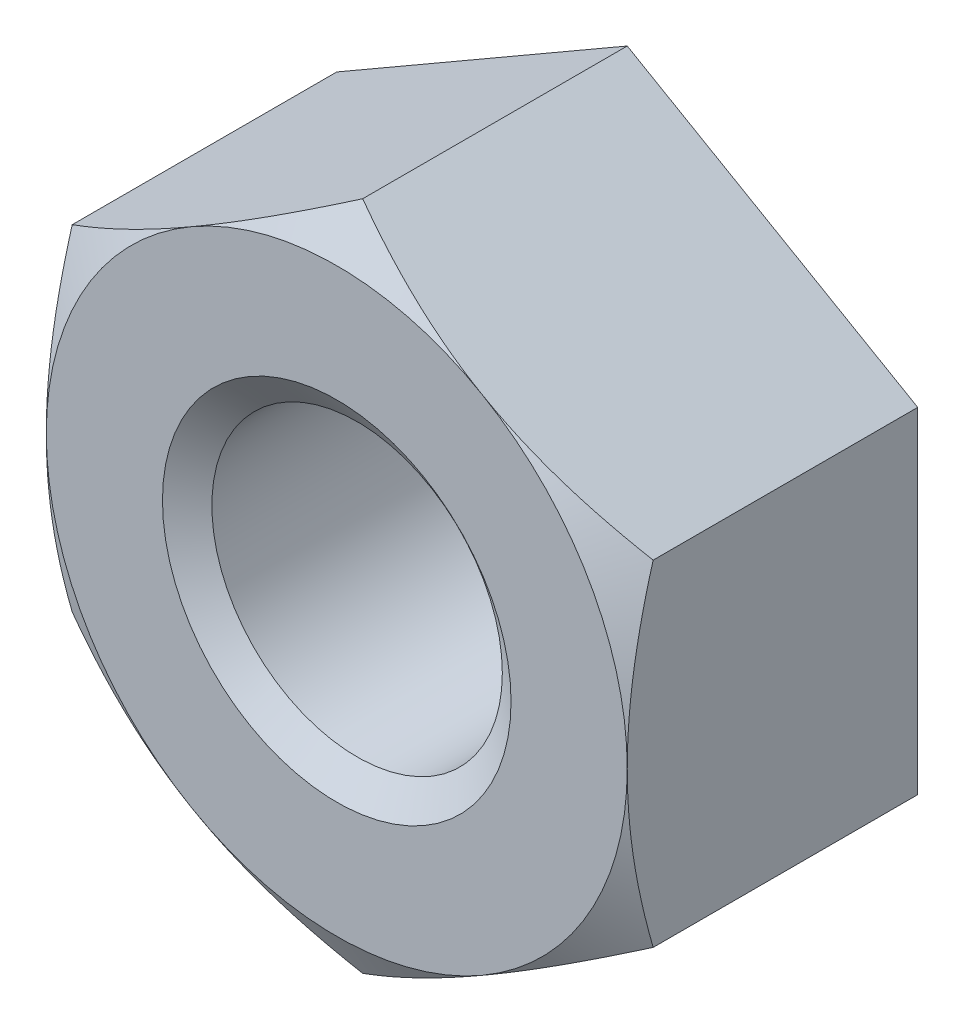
ISO-10303-21;
HEADER;
FILE_DESCRIPTION(('STEP AP214'),'2;1');
FILE_NAME('part.step','',(''),(''),'','','');
FILE_SCHEMA(('AUTOMOTIVE_DESIGN { 1 0 10303 214 1 1 1 1 }'));
ENDSEC;
DATA;
#1=APPLICATION_CONTEXT('core data for automotive mechanical design processes');
#2=APPLICATION_PROTOCOL_DEFINITION('international standard','automotive_design',2000,#1);
#3=PRODUCT_CONTEXT('',#1,'mechanical');
#4=PRODUCT('Part','Part','',(#3));
#5=PRODUCT_RELATED_PRODUCT_CATEGORY('part','',(#4));
#6=PRODUCT_DEFINITION_FORMATION('','',#4);
#7=PRODUCT_DEFINITION_CONTEXT('part definition',#1,'design');
#8=PRODUCT_DEFINITION('design','',#6,#7);
#9=PRODUCT_DEFINITION_SHAPE('','',#8);
#10=(LENGTH_UNIT() NAMED_UNIT(*) SI_UNIT(.MILLI.,.METRE.));
#11=(NAMED_UNIT(*) PLANE_ANGLE_UNIT() SI_UNIT($,.RADIAN.));
#12=(NAMED_UNIT(*) SI_UNIT($,.STERADIAN.) SOLID_ANGLE_UNIT());
#13=UNCERTAINTY_MEASURE_WITH_UNIT(LENGTH_MEASURE(1.E-05),#10,'distance_accuracy_value','');
#14=(GEOMETRIC_REPRESENTATION_CONTEXT(3) GLOBAL_UNCERTAINTY_ASSIGNED_CONTEXT((#13)) GLOBAL_UNIT_ASSIGNED_CONTEXT((#10,
#11,#12)) REPRESENTATION_CONTEXT('',''));
#15=CARTESIAN_POINT('',(0.,0.,0.));
#16=DIRECTION('',(0.,0.,1.));
#17=DIRECTION('',(1.,0.,0.));
#18=AXIS2_PLACEMENT_3D('',#15,#16,#17);
#19=CARTESIAN_POINT('',(0.,0.,-5.));
#20=DIRECTION('',(0.,0.,1.));
#21=DIRECTION('',(1.,0.,0.));
#22=AXIS2_PLACEMENT_3D('',#19,#20,#21);
#23=CYLINDRICAL_SURFACE('',#22,2.5);
#24=CARTESIAN_POINT('',(0.,0.,-0.350103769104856));
#25=DIRECTION('',(0.,0.,1.));
#26=DIRECTION('',(1.,0.,0.));
#27=AXIS2_PLACEMENT_3D('',#24,#25,#26);
#28=CIRCLE('',#27,2.5);
#29=CARTESIAN_POINT('',(2.5,0.,-0.350103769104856));
#30=VERTEX_POINT('',#29);
#31=EDGE_CURVE('E153',#30,#30,#28,.F.);
#32=ORIENTED_EDGE('',*,*,#31,.F.);
#33=EDGE_LOOP('',(#32));
#34=FACE_BOUND('',#33,.T.);
#35=CARTESIAN_POINT('',(0.,0.,-4.62449623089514));
#36=DIRECTION('',(0.,0.,-1.));
#37=DIRECTION('',(-1.,0.,0.));
#38=AXIS2_PLACEMENT_3D('',#35,#36,#37);
#39=CIRCLE('',#38,2.5);
#40=CARTESIAN_POINT('',(-2.5,0.,-4.62449623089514));
#41=VERTEX_POINT('',#40);
#42=EDGE_CURVE('E41',#41,#41,#39,.F.);
#43=ORIENTED_EDGE('',*,*,#42,.F.);
#44=EDGE_LOOP('',(#43));
#45=FACE_BOUND('',#44,.T.);
#46=ADVANCED_FACE('F36',(#34,#45),#23,.F.);
#47=CARTESIAN_POINT('',(0.,5.77350269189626,-5.));
#48=DIRECTION('',(0.,0.,-1.));
#49=DIRECTION('',(-1.,0.,0.));
#50=AXIS2_PLACEMENT_3D('',#47,#48,#49);
#51=PLANE('',#50);
#52=DIRECTION('',(-0.866025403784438,-0.500000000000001,0.));
#53=VECTOR('',#52,1.);
#54=CARTESIAN_POINT('',(0.,5.77350269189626,-5.));
#55=LINE('',#54,#53);
#56=CARTESIAN_POINT('',(0.,5.77350269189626,-5.));
#57=VERTEX_POINT('',#56);
#58=CARTESIAN_POINT('',(-5.,2.88675134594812,-5.));
#59=VERTEX_POINT('',#58);
#60=EDGE_CURVE('E221',#57,#59,#55,.T.);
#61=ORIENTED_EDGE('',*,*,#60,.F.);
#62=DIRECTION('',(-0.866025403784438,0.500000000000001,0.));
#63=VECTOR('',#62,1.);
#64=CARTESIAN_POINT('',(5.,2.88675134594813,-5.));
#65=LINE('',#64,#63);
#66=CARTESIAN_POINT('',(5.,2.88675134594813,-5.));
#67=VERTEX_POINT('',#66);
#68=EDGE_CURVE('E149',#67,#57,#65,.T.);
#69=ORIENTED_EDGE('',*,*,#68,.F.);
#70=DIRECTION('',(0.,-1.,0.));
#71=VECTOR('',#70,1.);
#72=CARTESIAN_POINT('',(5.,2.88675134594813,-5.));
#73=LINE('',#72,#71);
#74=CARTESIAN_POINT('',(5.,-2.88675134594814,-5.));
#75=VERTEX_POINT('',#74);
#76=EDGE_CURVE('E131',#67,#75,#73,.T.);
#77=ORIENTED_EDGE('',*,*,#76,.T.);
#78=DIRECTION('',(0.866025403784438,0.500000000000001,0.));
#79=VECTOR('',#78,1.);
#80=CARTESIAN_POINT('',(0.,-5.77350269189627,-5.));
#81=LINE('',#80,#79);
#82=CARTESIAN_POINT('',(0.,-5.77350269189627,-5.));
#83=VERTEX_POINT('',#82);
#84=EDGE_CURVE('E296',#83,#75,#81,.T.);
#85=ORIENTED_EDGE('',*,*,#84,.F.);
#86=DIRECTION('',(0.866025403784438,-0.500000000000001,0.));
#87=VECTOR('',#86,1.);
#88=CARTESIAN_POINT('',(-5.,-2.88675134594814,-5.));
#89=LINE('',#88,#87);
#90=CARTESIAN_POINT('',(-5.,-2.88675134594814,-5.));
#91=VERTEX_POINT('',#90);
#92=EDGE_CURVE('E299',#91,#83,#89,.T.);
#93=ORIENTED_EDGE('',*,*,#92,.F.);
#94=DIRECTION('',(0.,-1.,0.));
#95=VECTOR('',#94,1.);
#96=CARTESIAN_POINT('',(-5.,2.88675134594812,-5.));
#97=LINE('',#96,#95);
#98=EDGE_CURVE('E302',#59,#91,#97,.T.);
#99=ORIENTED_EDGE('',*,*,#98,.F.);
#100=EDGE_LOOP('',(#61,#69,#77,#85,#93,#99));
#101=FACE_BOUND('',#100,.T.);
#102=CARTESIAN_POINT('',(0.,0.,-5.));
#103=DIRECTION('',(0.,0.,-1.));
#104=DIRECTION('',(-1.,0.,0.));
#105=AXIS2_PLACEMENT_3D('',#102,#103,#104);
#106=CIRCLE('',#105,3.);
#107=CARTESIAN_POINT('',(-3.,0.,-5.));
#108=VERTEX_POINT('',#107);
#109=EDGE_CURVE('E156',#108,#108,#106,.F.);
#110=ORIENTED_EDGE('',*,*,#109,.T.);
#111=EDGE_LOOP('',(#110));
#112=FACE_BOUND('',#111,.T.);
#113=ADVANCED_FACE('F242',(#101,#112),#51,.T.);
#114=CARTESIAN_POINT('',(0.,5.77350269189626,0.));
#115=DIRECTION('',(0.,0.,-1.));
#116=DIRECTION('',(-1.,0.,0.));
#117=AXIS2_PLACEMENT_3D('',#114,#115,#116);
#118=PLANE('',#117);
#119=CARTESIAN_POINT('',(0.,0.,0.));
#120=DIRECTION('',(0.,0.,-1.));
#121=DIRECTION('',(-1.,0.,0.));
#122=AXIS2_PLACEMENT_3D('',#119,#120,#121);
#123=CIRCLE('',#122,5.);
#124=CARTESIAN_POINT('',(-5.,0.,0.));
#125=VERTEX_POINT('',#124);
#126=CARTESIAN_POINT('',(-2.50000000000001,4.33012701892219,0.));
#127=VERTEX_POINT('',#126);
#128=EDGE_CURVE('E11',#125,#127,#123,.T.);
#129=ORIENTED_EDGE('',*,*,#128,.F.);
#130=CARTESIAN_POINT('',(-2.50000000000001,-4.33012701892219,0.));
#131=VERTEX_POINT('',#130);
#132=EDGE_CURVE('E48',#131,#125,#123,.T.);
#133=ORIENTED_EDGE('',*,*,#132,.F.);
#134=CARTESIAN_POINT('',(2.50000000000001,-4.33012701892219,0.));
#135=VERTEX_POINT('',#134);
#136=EDGE_CURVE('E152',#135,#131,#123,.T.);
#137=ORIENTED_EDGE('',*,*,#136,.F.);
#138=CARTESIAN_POINT('',(5.,0.,0.));
#139=VERTEX_POINT('',#138);
#140=EDGE_CURVE('E293',#139,#135,#123,.T.);
#141=ORIENTED_EDGE('',*,*,#140,.F.);
#142=CARTESIAN_POINT('',(0.,0.,0.));
#143=DIRECTION('',(0.,0.,1.));
#144=DIRECTION('',(1.,0.,0.));
#145=AXIS2_PLACEMENT_3D('',#142,#143,#144);
#146=CIRCLE('',#145,5.);
#147=CARTESIAN_POINT('',(2.50000000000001,4.33012701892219,0.));
#148=VERTEX_POINT('',#147);
#149=EDGE_CURVE('E112',#139,#148,#146,.T.);
#150=ORIENTED_EDGE('',*,*,#149,.T.);
#151=EDGE_CURVE('E46',#127,#148,#123,.T.);
#152=ORIENTED_EDGE('',*,*,#151,.F.);
#153=EDGE_LOOP('',(#129,#133,#137,#141,#150,#152));
#154=FACE_BOUND('',#153,.T.);
#155=CARTESIAN_POINT('',(0.,0.,0.));
#156=DIRECTION('',(0.,0.,1.));
#157=DIRECTION('',(1.,0.,0.));
#158=AXIS2_PLACEMENT_3D('',#155,#156,#157);
#159=CIRCLE('',#158,3.);
#160=CARTESIAN_POINT('',(3.,0.,0.));
#161=VERTEX_POINT('',#160);
#162=EDGE_CURVE('E155',#161,#161,#159,.T.);
#163=ORIENTED_EDGE('',*,*,#162,.F.);
#164=EDGE_LOOP('',(#163));
#165=FACE_BOUND('',#164,.T.);
#166=ADVANCED_FACE('F226',(#154,#165),#118,.F.);
#167=CARTESIAN_POINT('',(0.,5.77350269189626,-5.));
#168=DIRECTION('',(-0.500000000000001,0.866025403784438,0.));
#169=DIRECTION('',(-0.866025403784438,-0.500000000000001,0.));
#170=AXIS2_PLACEMENT_3D('',#167,#168,#169);
#171=PLANE('',#170);
#172=DIRECTION('',(0.,0.,1.));
#173=VECTOR('',#172,1.);
#174=CARTESIAN_POINT('',(-5.,2.88675134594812,-5.));
#175=LINE('',#174,#173);
#176=CARTESIAN_POINT('',(-5.,2.88675134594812,-0.446581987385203));
#177=VERTEX_POINT('',#176);
#178=EDGE_CURVE('E147',#59,#177,#175,.T.);
#179=ORIENTED_EDGE('',*,*,#178,.T.);
#180=CARTESIAN_POINT('',(-5.0002,2.88663587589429,-0.44664865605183));
#181=CARTESIAN_POINT('',(-4.78046540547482,3.01349970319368,-0.373386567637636));
#182=CARTESIAN_POINT('',(-4.55885141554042,3.14144859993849,-0.306751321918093));
#183=CARTESIAN_POINT('',(-4.11178600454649,3.39956193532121,-0.190438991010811));
#184=CARTESIAN_POINT('',(-3.88632664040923,3.52973095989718,-0.140803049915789));
#185=CARTESIAN_POINT('',(-3.43816769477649,3.78847564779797,-0.0635510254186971));
#186=CARTESIAN_POINT('',(-3.21553790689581,3.91701101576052,-0.0354203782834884));
#187=CARTESIAN_POINT('',(-2.88081009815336,4.11026620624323,-0.010194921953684));
#188=CARTESIAN_POINT('',(-2.76915780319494,4.17472868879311,-0.00461345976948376));
#189=CARTESIAN_POINT('',(-2.5457500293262,4.30371322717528,0.000797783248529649));
#190=CARTESIAN_POINT('',(-2.43399455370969,4.36823528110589,0.00062774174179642));
#191=CARTESIAN_POINT('',(-2.12781576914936,4.54500768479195,-0.00775363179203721));
#192=CARTESIAN_POINT('',(-1.93349391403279,4.65719946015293,-0.0218297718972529));
#193=CARTESIAN_POINT('',(-1.54613989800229,4.88083840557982,-0.0664652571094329));
#194=CARTESIAN_POINT('',(-1.35310909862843,4.99228478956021,-0.0970398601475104));
#195=CARTESIAN_POINT('',(-0.964974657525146,5.21637431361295,-0.173468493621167));
#196=CARTESIAN_POINT('',(-0.769920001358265,5.32898917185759,-0.219646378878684));
#197=CARTESIAN_POINT('',(-0.382719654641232,5.55253939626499,-0.324451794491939));
#198=CARTESIAN_POINT('',(-0.190569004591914,5.66347762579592,-0.383054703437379));
#199=CARTESIAN_POINT('',(0.000199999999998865,5.7736181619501,-0.446648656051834));
#200=B_SPLINE_CURVE_WITH_KNOTS('',3,(#180,#181,#182,#183,#184,#185,#186,#187,#188,#189,#190,
#191,#192,#193,#194,#195,#196,#197,#198,#199),.UNSPECIFIED.,.F.,.F.,(4,2,2,2,2,2,2,2,2,4),(0.,
0.792555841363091,1.58701660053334,2.36181537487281,2.74884076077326,3.13585419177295,
3.8096236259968,4.4840172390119,5.17336882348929,5.86136694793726),.UNSPECIFIED.);
#201=EDGE_CURVE('E117',#177,#127,#200,.T.);
#202=ORIENTED_EDGE('',*,*,#201,.T.);
#203=CARTESIAN_POINT('',(0.,5.77350269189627,-0.446581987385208));
#204=VERTEX_POINT('',#203);
#205=EDGE_CURVE('E55',#127,#204,#200,.T.);
#206=ORIENTED_EDGE('',*,*,#205,.T.);
#207=DIRECTION('',(0.,0.,1.));
#208=VECTOR('',#207,1.);
#209=CARTESIAN_POINT('',(0.,5.77350269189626,-5.));
#210=LINE('',#209,#208);
#211=EDGE_CURVE('E133',#57,#204,#210,.T.);
#212=ORIENTED_EDGE('',*,*,#211,.F.);
#213=ORIENTED_EDGE('',*,*,#60,.T.);
#214=EDGE_LOOP('',(#179,#202,#206,#212,#213));
#215=FACE_BOUND('',#214,.T.);
#216=ADVANCED_FACE('F38',(#215),#171,.T.);
#217=CARTESIAN_POINT('',(5.,2.88675134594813,-5.));
#218=DIRECTION('',(0.500000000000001,0.866025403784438,0.));
#219=DIRECTION('',(-0.866025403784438,0.500000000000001,0.));
#220=AXIS2_PLACEMENT_3D('',#217,#218,#219);
#221=PLANE('',#220);
#222=ORIENTED_EDGE('',*,*,#211,.T.);
#223=CARTESIAN_POINT('',(-0.000200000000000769,5.7736181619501,-0.446648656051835));
#224=CARTESIAN_POINT('',(0.219534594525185,5.64675433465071,-0.37338656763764));
#225=CARTESIAN_POINT('',(0.44114858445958,5.5188054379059,-0.306751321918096));
#226=CARTESIAN_POINT('',(0.888213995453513,5.26069210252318,-0.190438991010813));
#227=CARTESIAN_POINT('',(1.11367335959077,5.13052307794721,-0.140803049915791));
#228=CARTESIAN_POINT('',(1.56183230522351,4.87177839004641,-0.0635510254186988));
#229=CARTESIAN_POINT('',(1.78446209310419,4.74324302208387,-0.0354203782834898));
#230=CARTESIAN_POINT('',(2.11918990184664,4.54998783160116,-0.0101949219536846));
#231=CARTESIAN_POINT('',(2.23084219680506,4.48552534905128,-0.00461345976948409));
#232=CARTESIAN_POINT('',(2.4542499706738,4.35654081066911,0.000797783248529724));
#233=CARTESIAN_POINT('',(2.56600544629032,4.2920187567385,0.000627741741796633));
#234=CARTESIAN_POINT('',(2.87218423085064,4.11524635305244,-0.00775363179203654));
#235=CARTESIAN_POINT('',(3.06650608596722,4.00305457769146,-0.0218297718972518));
#236=CARTESIAN_POINT('',(3.45386010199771,3.77941563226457,-0.0664652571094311));
#237=CARTESIAN_POINT('',(3.64689090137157,3.66796924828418,-0.0970398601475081));
#238=CARTESIAN_POINT('',(4.03502534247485,3.44387972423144,-0.173468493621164));
#239=CARTESIAN_POINT('',(4.23007999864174,3.3312648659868,-0.21964637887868));
#240=CARTESIAN_POINT('',(4.61728034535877,3.1077146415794,-0.324451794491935));
#241=CARTESIAN_POINT('',(4.80943099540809,2.99677641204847,-0.383054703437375));
#242=CARTESIAN_POINT('',(5.0002,2.88663587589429,-0.44664865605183));
#243=B_SPLINE_CURVE_WITH_KNOTS('',3,(#223,#224,#225,#226,#227,#228,#229,#230,#231,#232,#233,
#234,#235,#236,#237,#238,#239,#240,#241,#242),.UNSPECIFIED.,.F.,.F.,(4,2,2,2,2,2,2,2,2,4),(0.,
0.792555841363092,1.58701660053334,2.36181537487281,2.74884076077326,3.13585419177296,
3.8096236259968,4.4840172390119,5.17336882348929,5.86136694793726),.UNSPECIFIED.);
#244=EDGE_CURVE('E127',#204,#148,#243,.T.);
#245=ORIENTED_EDGE('',*,*,#244,.T.);
#246=CARTESIAN_POINT('',(5.,2.88675134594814,-0.446581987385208));
#247=VERTEX_POINT('',#246);
#248=EDGE_CURVE('E62',#148,#247,#243,.T.);
#249=ORIENTED_EDGE('',*,*,#248,.T.);
#250=DIRECTION('',(0.,0.,1.));
#251=VECTOR('',#250,1.);
#252=CARTESIAN_POINT('',(5.,2.88675134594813,-5.));
#253=LINE('',#252,#251);
#254=EDGE_CURVE('E125',#67,#247,#253,.T.);
#255=ORIENTED_EDGE('',*,*,#254,.F.);
#256=ORIENTED_EDGE('',*,*,#68,.T.);
#257=EDGE_LOOP('',(#222,#245,#249,#255,#256));
#258=FACE_BOUND('',#257,.T.);
#259=ADVANCED_FACE('F123',(#258),#221,.T.);
#260=CARTESIAN_POINT('',(5.,2.88675134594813,-5.));
#261=DIRECTION('',(-1.,0.,0.));
#262=DIRECTION('',(0.,0.,1.));
#263=AXIS2_PLACEMENT_3D('',#260,#261,#262);
#264=PLANE('',#263);
#265=CARTESIAN_POINT('',(5.,-7.65608998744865,-2.3926335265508));
#266=CARTESIAN_POINT('',(5.,-7.43656171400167,-2.28654533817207));
#267=CARTESIAN_POINT('',(5.,-7.21651440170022,-2.18151175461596));
#268=CARTESIAN_POINT('',(5.,-6.77510105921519,-1.97415643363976));
#269=CARTESIAN_POINT('',(5.,-6.55373480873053,-1.87183516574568));
#270=CARTESIAN_POINT('',(5.,-6.10820714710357,-1.66996807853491));
#271=CARTESIAN_POINT('',(5.,-5.88403698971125,-1.5704414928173));
#272=CARTESIAN_POINT('',(5.,-5.43385418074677,-1.37566323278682));
#273=CARTESIAN_POINT('',(5.,-5.20784162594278,-1.28041133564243));
#274=CARTESIAN_POINT('',(5.,-4.75080884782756,-1.09418830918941));
#275=CARTESIAN_POINT('',(5.,-4.51976121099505,-1.0032840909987));
#276=CARTESIAN_POINT('',(5.,-4.054940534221,-0.82859530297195));
#277=CARTESIAN_POINT('',(5.,-3.82116719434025,-0.744811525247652));
#278=CARTESIAN_POINT('',(5.,-3.35100416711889,-0.58661463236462));
#279=CARTESIAN_POINT('',(5.,-3.11462125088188,-0.512181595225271));
#280=CARTESIAN_POINT('',(5.,-2.63849247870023,-0.375104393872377));
#281=CARTESIAN_POINT('',(5.,-2.3987477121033,-0.312456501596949));
#282=CARTESIAN_POINT('',(5.,-1.91574303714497,-0.201987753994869));
#283=CARTESIAN_POINT('',(5.,-1.672482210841,-0.154170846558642));
#284=CARTESIAN_POINT('',(5.,-1.18299359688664,-0.0765955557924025));
#285=CARTESIAN_POINT('',(5.,-0.936765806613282,-0.0468371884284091));
#286=CARTESIAN_POINT('',(5.,-0.567032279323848,-0.0176512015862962));
#287=CARTESIAN_POINT('',(5.,-0.44410529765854,-0.0104963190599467));
#288=CARTESIAN_POINT('',(5.,-0.198053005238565,-0.0013954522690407));
#289=CARTESIAN_POINT('',(5.,-0.0749276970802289,0.00055059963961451));
#290=CARTESIAN_POINT('',(5.,0.171257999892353,-0.000818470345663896));
#291=CARTESIAN_POINT('',(5.,0.294318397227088,-0.00413211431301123));
#292=CARTESIAN_POINT('',(5.,0.54019273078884,-0.0159365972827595));
#293=CARTESIAN_POINT('',(5.,0.663006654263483,-0.0244276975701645));
#294=CARTESIAN_POINT('',(5.,0.960681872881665,-0.0511063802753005));
#295=CARTESIAN_POINT('',(5.,1.1353143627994,-0.071888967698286));
#296=CARTESIAN_POINT('',(5.,1.48321675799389,-0.122765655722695));
#297=CARTESIAN_POINT('',(5.,1.65648647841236,-0.152860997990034));
#298=CARTESIAN_POINT('',(5.,2.00155426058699,-0.221298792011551));
#299=CARTESIAN_POINT('',(5.,2.17335067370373,-0.259649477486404));
#300=CARTESIAN_POINT('',(5.,2.51518168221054,-0.343428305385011));
#301=CARTESIAN_POINT('',(5.,2.6852163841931,-0.388856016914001));
#302=CARTESIAN_POINT('',(5.,3.02770318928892,-0.486887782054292));
#303=CARTESIAN_POINT('',(5.,3.20011248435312,-0.539640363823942));
#304=CARTESIAN_POINT('',(5.,3.54310870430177,-0.650357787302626));
#305=CARTESIAN_POINT('',(5.,3.71369679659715,-0.70831903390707));
#306=CARTESIAN_POINT('',(5.,4.05236610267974,-0.828256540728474));
#307=CARTESIAN_POINT('',(5.,4.22045602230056,-0.890208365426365));
#308=CARTESIAN_POINT('',(5.,4.55533171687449,-1.01774823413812));
#309=CARTESIAN_POINT('',(5.,4.72211693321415,-1.08333774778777));
#310=CARTESIAN_POINT('',(5.,4.88829623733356,-1.15038625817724));
#311=B_SPLINE_CURVE_WITH_KNOTS('',3,(#265,#266,#267,#268,#269,#270,#271,#272,#273,#274,#275,
#276,#277,#278,#279,#280,#281,#282,#283,#284,#285,#286,#287,#288,#289,#290,#291,#292,#293,#294,
#295,#296,#297,#298,#299,#300,#301,#302,#303,#304,#305,#306,#307,#308,#309,#310),.UNSPECIFIED.,
.F.,.F.,(4,2,2,2,2,2,2,2,2,2,2,2,2,2,2,2,2,2,2,2,2,2,4),(0.,0.731464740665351,1.46305528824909,
2.19883243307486,2.93457117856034,3.67934251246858,4.42419659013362,5.1674358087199,
5.91043951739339,6.65364083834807,7.39684281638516,7.76615414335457,8.13546067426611,
8.50466345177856,8.87388486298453,9.40118542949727,9.92855633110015,10.4564556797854,
10.9843228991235,11.525120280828,12.065547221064,12.6029322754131,13.1405360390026),.UNSPECIFIED.);
#312=CARTESIAN_POINT('',(5.,-2.88675134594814,-0.446581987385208));
#313=VERTEX_POINT('',#312);
#314=EDGE_CURVE('E119',#313,#139,#311,.T.);
#315=ORIENTED_EDGE('',*,*,#314,.F.);
#316=DIRECTION('',(0.,0.,1.));
#317=VECTOR('',#316,1.);
#318=CARTESIAN_POINT('',(5.,-2.88675134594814,-5.));
#319=LINE('',#318,#317);
#320=EDGE_CURVE('E134',#75,#313,#319,.T.);
#321=ORIENTED_EDGE('',*,*,#320,.F.);
#322=ORIENTED_EDGE('',*,*,#76,.F.);
#323=ORIENTED_EDGE('',*,*,#254,.T.);
#324=EDGE_CURVE('E109',#139,#247,#311,.T.);
#325=ORIENTED_EDGE('',*,*,#324,.F.);
#326=EDGE_LOOP('',(#315,#321,#322,#323,#325));
#327=FACE_BOUND('',#326,.T.);
#328=ADVANCED_FACE('F129',(#327),#264,.F.);
#329=CARTESIAN_POINT('',(0.,-5.77350269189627,-5.));
#330=DIRECTION('',(0.500000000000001,-0.866025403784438,0.));
#331=DIRECTION('',(0.866025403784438,0.500000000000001,0.));
#332=AXIS2_PLACEMENT_3D('',#329,#330,#331);
#333=PLANE('',#332);
#334=ORIENTED_EDGE('',*,*,#320,.T.);
#335=CARTESIAN_POINT('',(5.0002,-2.8866358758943,-0.446648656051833));
#336=CARTESIAN_POINT('',(4.78046540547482,-3.01349970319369,-0.373386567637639));
#337=CARTESIAN_POINT('',(4.55885141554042,-3.1414485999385,-0.306751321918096));
#338=CARTESIAN_POINT('',(4.11178600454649,-3.39956193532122,-0.190438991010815));
#339=CARTESIAN_POINT('',(3.88632664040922,-3.52973095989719,-0.140803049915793));
#340=CARTESIAN_POINT('',(3.43816769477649,-3.78847564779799,-0.063551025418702));
#341=CARTESIAN_POINT('',(3.2155379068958,-3.91701101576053,-0.0354203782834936));
#342=CARTESIAN_POINT('',(2.88081009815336,-4.11026620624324,-0.0101949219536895));
#343=CARTESIAN_POINT('',(2.76915780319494,-4.17472868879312,-0.00461345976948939));
#344=CARTESIAN_POINT('',(2.5457500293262,-4.30371322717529,0.000797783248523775));
#345=CARTESIAN_POINT('',(2.43399455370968,-4.3682352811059,0.000627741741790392));
#346=CARTESIAN_POINT('',(2.12781576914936,-4.54500768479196,-0.00775363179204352));
#347=CARTESIAN_POINT('',(1.93349391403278,-4.65719946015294,-0.0218297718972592));
#348=CARTESIAN_POINT('',(1.54613989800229,-4.88083840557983,-0.0664652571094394));
#349=CARTESIAN_POINT('',(1.35310909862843,-4.99228478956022,-0.097039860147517));
#350=CARTESIAN_POINT('',(0.964974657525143,-5.21637431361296,-0.173468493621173));
#351=CARTESIAN_POINT('',(0.769920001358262,-5.3289891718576,-0.21964637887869));
#352=CARTESIAN_POINT('',(0.38271965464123,-5.552539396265,-0.324451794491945));
#353=CARTESIAN_POINT('',(0.190569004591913,-5.66347762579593,-0.383054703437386));
#354=CARTESIAN_POINT('',(-0.000200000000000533,-5.77361816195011,-0.446648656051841));
#355=B_SPLINE_CURVE_WITH_KNOTS('',3,(#335,#336,#337,#338,#339,#340,#341,#342,#343,#344,#345,
#346,#347,#348,#349,#350,#351,#352,#353,#354),.UNSPECIFIED.,.F.,.F.,(4,2,2,2,2,2,2,2,2,4),(0.,
0.792555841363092,1.58701660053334,2.36181537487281,2.74884076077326,3.13585419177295,
3.8096236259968,4.4840172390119,5.17336882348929,5.86136694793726),.UNSPECIFIED.);
#356=EDGE_CURVE('E289',#313,#135,#355,.T.);
#357=ORIENTED_EDGE('',*,*,#356,.T.);
#358=CARTESIAN_POINT('',(0.,-5.77350269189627,-0.446581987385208));
#359=VERTEX_POINT('',#358);
#360=EDGE_CURVE('E202',#135,#359,#355,.T.);
#361=ORIENTED_EDGE('',*,*,#360,.T.);
#362=DIRECTION('',(0.,0.,1.));
#363=VECTOR('',#362,1.);
#364=CARTESIAN_POINT('',(0.,-5.77350269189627,-5.));
#365=LINE('',#364,#363);
#366=EDGE_CURVE('E138',#83,#359,#365,.T.);
#367=ORIENTED_EDGE('',*,*,#366,.F.);
#368=ORIENTED_EDGE('',*,*,#84,.T.);
#369=EDGE_LOOP('',(#334,#357,#361,#367,#368));
#370=FACE_BOUND('',#369,.T.);
#371=ADVANCED_FACE('F229',(#370),#333,.T.);
#372=CARTESIAN_POINT('',(-5.,-2.88675134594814,-5.));
#373=DIRECTION('',(-0.500000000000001,-0.866025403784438,0.));
#374=DIRECTION('',(0.866025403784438,-0.500000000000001,0.));
#375=AXIS2_PLACEMENT_3D('',#372,#373,#374);
#376=PLANE('',#375);
#377=ORIENTED_EDGE('',*,*,#366,.T.);
#378=CARTESIAN_POINT('',(0.000200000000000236,-5.77361816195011,-0.446648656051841));
#379=CARTESIAN_POINT('',(-0.219534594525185,-5.64675433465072,-0.373386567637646));
#380=CARTESIAN_POINT('',(-0.441148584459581,-5.51880543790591,-0.306751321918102));
#381=CARTESIAN_POINT('',(-0.888213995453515,-5.26069210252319,-0.19043899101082));
#382=CARTESIAN_POINT('',(-1.11367335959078,-5.13052307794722,-0.140803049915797));
#383=CARTESIAN_POINT('',(-1.56183230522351,-4.87177839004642,-0.0635510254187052));
#384=CARTESIAN_POINT('',(-1.7844620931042,-4.74324302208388,-0.035420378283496));
#385=CARTESIAN_POINT('',(-2.11918990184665,-4.54998783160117,-0.0101949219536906));
#386=CARTESIAN_POINT('',(-2.23084219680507,-4.48552534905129,-0.00461345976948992));
#387=CARTESIAN_POINT('',(-2.4542499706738,-4.35654081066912,0.000797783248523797));
#388=CARTESIAN_POINT('',(-2.56600544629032,-4.29201875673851,0.000627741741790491));
#389=CARTESIAN_POINT('',(-2.87218423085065,-4.11524635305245,-0.00775363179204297));
#390=CARTESIAN_POINT('',(-3.06650608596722,-4.00305457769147,-0.021829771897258));
#391=CARTESIAN_POINT('',(-3.45386010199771,-3.77941563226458,-0.0664652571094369));
#392=CARTESIAN_POINT('',(-3.64689090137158,-3.66796924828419,-0.0970398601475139));
#393=CARTESIAN_POINT('',(-4.03502534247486,-3.44387972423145,-0.173468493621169));
#394=CARTESIAN_POINT('',(-4.23007999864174,-3.33126486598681,-0.219646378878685));
#395=CARTESIAN_POINT('',(-4.61728034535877,-3.10771464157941,-0.324451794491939));
#396=CARTESIAN_POINT('',(-4.80943099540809,-2.99677641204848,-0.383054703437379));
#397=CARTESIAN_POINT('',(-5.0002,-2.8866358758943,-0.446648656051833));
#398=B_SPLINE_CURVE_WITH_KNOTS('',3,(#378,#379,#380,#381,#382,#383,#384,#385,#386,#387,#388,
#389,#390,#391,#392,#393,#394,#395,#396,#397),.UNSPECIFIED.,.F.,.F.,(4,2,2,2,2,2,2,2,2,4),(0.,
0.792555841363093,1.58701660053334,2.36181537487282,2.74884076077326,3.13585419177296,
3.8096236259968,4.4840172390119,5.17336882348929,5.86136694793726),.UNSPECIFIED.);
#399=EDGE_CURVE('E287',#359,#131,#398,.T.);
#400=ORIENTED_EDGE('',*,*,#399,.T.);
#401=CARTESIAN_POINT('',(-5.,-2.88675134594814,-0.446581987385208));
#402=VERTEX_POINT('',#401);
#403=EDGE_CURVE('E178',#131,#402,#398,.T.);
#404=ORIENTED_EDGE('',*,*,#403,.T.);
#405=DIRECTION('',(0.,0.,1.));
#406=VECTOR('',#405,1.);
#407=CARTESIAN_POINT('',(-5.,-2.88675134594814,-5.));
#408=LINE('',#407,#406);
#409=EDGE_CURVE('E144',#91,#402,#408,.T.);
#410=ORIENTED_EDGE('',*,*,#409,.F.);
#411=ORIENTED_EDGE('',*,*,#92,.T.);
#412=EDGE_LOOP('',(#377,#400,#404,#410,#411));
#413=FACE_BOUND('',#412,.T.);
#414=ADVANCED_FACE('F232',(#413),#376,.T.);
#415=CARTESIAN_POINT('',(-5.,2.88675134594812,-5.));
#416=DIRECTION('',(-1.,0.,0.));
#417=DIRECTION('',(0.,0.,1.));
#418=AXIS2_PLACEMENT_3D('',#415,#416,#417);
#419=PLANE('',#418);
#420=ORIENTED_EDGE('',*,*,#409,.T.);
#421=CARTESIAN_POINT('',(-5.,-7.65608998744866,-2.3926335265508));
#422=CARTESIAN_POINT('',(-5.,-7.43656171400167,-2.28654533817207));
#423=CARTESIAN_POINT('',(-5.,-7.21651440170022,-2.18151175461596));
#424=CARTESIAN_POINT('',(-5.,-6.77510105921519,-1.97415643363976));
#425=CARTESIAN_POINT('',(-5.,-6.55373480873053,-1.87183516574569));
#426=CARTESIAN_POINT('',(-5.,-6.10820714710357,-1.66996807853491));
#427=CARTESIAN_POINT('',(-5.,-5.88403698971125,-1.57044149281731));
#428=CARTESIAN_POINT('',(-5.,-5.43385418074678,-1.37566323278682));
#429=CARTESIAN_POINT('',(-5.,-5.20784162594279,-1.28041133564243));
#430=CARTESIAN_POINT('',(-5.,-4.75080884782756,-1.09418830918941));
#431=CARTESIAN_POINT('',(-5.,-4.51976121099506,-1.0032840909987));
#432=CARTESIAN_POINT('',(-5.,-4.054940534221,-0.82859530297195));
#433=CARTESIAN_POINT('',(-5.,-3.82116719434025,-0.744811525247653));
#434=CARTESIAN_POINT('',(-5.,-3.35100416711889,-0.58661463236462));
#435=CARTESIAN_POINT('',(-5.,-3.11462125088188,-0.512181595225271));
#436=CARTESIAN_POINT('',(-5.,-2.63849247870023,-0.375104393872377));
#437=CARTESIAN_POINT('',(-5.,-2.3987477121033,-0.312456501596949));
#438=CARTESIAN_POINT('',(-5.,-1.91574303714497,-0.201987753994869));
#439=CARTESIAN_POINT('',(-5.,-1.672482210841,-0.154170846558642));
#440=CARTESIAN_POINT('',(-5.,-1.18299359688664,-0.0765955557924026));
#441=CARTESIAN_POINT('',(-5.,-0.936765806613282,-0.0468371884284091));
#442=CARTESIAN_POINT('',(-5.,-0.567032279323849,-0.0176512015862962));
#443=CARTESIAN_POINT('',(-5.,-0.444105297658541,-0.0104963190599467));
#444=CARTESIAN_POINT('',(-5.,-0.198053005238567,-0.00139545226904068));
#445=CARTESIAN_POINT('',(-5.,-0.0749276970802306,0.000550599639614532));
#446=CARTESIAN_POINT('',(-5.,0.171257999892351,-0.000818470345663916));
#447=CARTESIAN_POINT('',(-5.,0.294318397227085,-0.00413211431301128));
#448=CARTESIAN_POINT('',(-5.,0.540192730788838,-0.0159365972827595));
#449=CARTESIAN_POINT('',(-5.,0.663006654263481,-0.0244276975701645));
#450=CARTESIAN_POINT('',(-5.,0.960681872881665,-0.0511063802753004));
#451=CARTESIAN_POINT('',(-5.,1.1353143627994,-0.071888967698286));
#452=CARTESIAN_POINT('',(-5.,1.48321675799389,-0.122765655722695));
#453=CARTESIAN_POINT('',(-5.,1.65648647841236,-0.152860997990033));
#454=CARTESIAN_POINT('',(-5.,2.00155426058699,-0.22129879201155));
#455=CARTESIAN_POINT('',(-5.,2.17335067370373,-0.259649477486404));
#456=CARTESIAN_POINT('',(-5.,2.51518168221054,-0.34342830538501));
#457=CARTESIAN_POINT('',(-5.,2.6852163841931,-0.388856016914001));
#458=CARTESIAN_POINT('',(-5.,3.02770318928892,-0.486887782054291));
#459=CARTESIAN_POINT('',(-5.,3.20011248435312,-0.539640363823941));
#460=CARTESIAN_POINT('',(-5.,3.54310870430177,-0.650357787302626));
#461=CARTESIAN_POINT('',(-5.,3.71369679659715,-0.708319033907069));
#462=CARTESIAN_POINT('',(-5.,4.05236610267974,-0.828256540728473));
#463=CARTESIAN_POINT('',(-5.,4.22045602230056,-0.890208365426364));
#464=CARTESIAN_POINT('',(-5.,4.55533171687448,-1.01774823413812));
#465=CARTESIAN_POINT('',(-5.,4.72211693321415,-1.08333774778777));
#466=CARTESIAN_POINT('',(-5.,4.88829623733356,-1.15038625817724));
#467=B_SPLINE_CURVE_WITH_KNOTS('',3,(#421,#422,#423,#424,#425,#426,#427,#428,#429,#430,#431,
#432,#433,#434,#435,#436,#437,#438,#439,#440,#441,#442,#443,#444,#445,#446,#447,#448,#449,#450,
#451,#452,#453,#454,#455,#456,#457,#458,#459,#460,#461,#462,#463,#464,#465,#466),.UNSPECIFIED.,
.F.,.F.,(4,2,2,2,2,2,2,2,2,2,2,2,2,2,2,2,2,2,2,2,2,2,4),(0.,0.731464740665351,1.46305528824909,
2.19883243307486,2.93457117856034,3.67934251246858,4.42419659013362,5.1674358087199,
5.91043951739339,6.65364083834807,7.39684281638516,7.76615414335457,8.13546067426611,
8.50466345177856,8.87388486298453,9.40118542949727,9.92855633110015,10.4564556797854,
10.9843228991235,11.525120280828,12.065547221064,12.6029322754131,13.1405360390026),.UNSPECIFIED.);
#468=EDGE_CURVE('E177',#402,#125,#467,.T.);
#469=ORIENTED_EDGE('',*,*,#468,.T.);
#470=EDGE_CURVE('E170',#125,#177,#467,.T.);
#471=ORIENTED_EDGE('',*,*,#470,.T.);
#472=ORIENTED_EDGE('',*,*,#178,.F.);
#473=ORIENTED_EDGE('',*,*,#98,.T.);
#474=EDGE_LOOP('',(#420,#469,#471,#472,#473));
#475=FACE_BOUND('',#474,.T.);
#476=ADVANCED_FACE('F184',(#475),#419,.T.);
#477=CARTESIAN_POINT('',(0.,0.,0.));
#478=DIRECTION('',(0.,0.,-1.));
#479=DIRECTION('',(-1.,0.,0.));
#480=AXIS2_PLACEMENT_3D('',#477,#478,#479);
#481=CONICAL_SURFACE('',#480,5.,1.0471975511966);
#482=ORIENTED_EDGE('',*,*,#132,.T.);
#483=ORIENTED_EDGE('',*,*,#468,.F.);
#484=ORIENTED_EDGE('',*,*,#403,.F.);
#485=EDGE_LOOP('',(#482,#483,#484));
#486=FACE_BOUND('',#485,.T.);
#487=ADVANCED_FACE('F186',(#486),#481,.T.);
#488=ORIENTED_EDGE('',*,*,#136,.T.);
#489=ORIENTED_EDGE('',*,*,#399,.F.);
#490=ORIENTED_EDGE('',*,*,#360,.F.);
#491=EDGE_LOOP('',(#488,#489,#490));
#492=FACE_BOUND('',#491,.T.);
#493=ADVANCED_FACE('F191',(#492),#481,.T.);
#494=ORIENTED_EDGE('',*,*,#314,.T.);
#495=ORIENTED_EDGE('',*,*,#140,.T.);
#496=ORIENTED_EDGE('',*,*,#356,.F.);
#497=EDGE_LOOP('',(#494,#495,#496));
#498=FACE_BOUND('',#497,.T.);
#499=ADVANCED_FACE('F268',(#498),#481,.T.);
#500=ORIENTED_EDGE('',*,*,#149,.F.);
#501=ORIENTED_EDGE('',*,*,#324,.T.);
#502=ORIENTED_EDGE('',*,*,#248,.F.);
#503=EDGE_LOOP('',(#500,#501,#502));
#504=FACE_BOUND('',#503,.T.);
#505=ADVANCED_FACE('F110',(#504),#481,.T.);
#506=ORIENTED_EDGE('',*,*,#151,.T.);
#507=ORIENTED_EDGE('',*,*,#244,.F.);
#508=ORIENTED_EDGE('',*,*,#205,.F.);
#509=EDGE_LOOP('',(#506,#507,#508));
#510=FACE_BOUND('',#509,.T.);
#511=ADVANCED_FACE('F193',(#510),#481,.T.);
#512=ORIENTED_EDGE('',*,*,#470,.F.);
#513=ORIENTED_EDGE('',*,*,#128,.T.);
#514=ORIENTED_EDGE('',*,*,#201,.F.);
#515=EDGE_LOOP('',(#512,#513,#514));
#516=FACE_BOUND('',#515,.T.);
#517=ADVANCED_FACE('F262',(#516),#481,.T.);
#518=CARTESIAN_POINT('',(0.,0.,-0.385114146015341));
#519=DIRECTION('',(0.,0.,1.));
#520=DIRECTION('',(1.,0.,0.));
#521=AXIS2_PLACEMENT_3D('',#518,#519,#520);
#522=CONICAL_SURFACE('',#521,2.45,0.95993108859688);
#523=ORIENTED_EDGE('',*,*,#162,.T.);
#524=EDGE_LOOP('',(#523));
#525=FACE_BOUND('',#524,.T.);
#526=ORIENTED_EDGE('',*,*,#31,.T.);
#527=EDGE_LOOP('',(#526));
#528=FACE_BOUND('',#527,.T.);
#529=ADVANCED_FACE('F194',(#525,#528),#522,.F.);
#530=CARTESIAN_POINT('',(0.,0.,-4.9746));
#531=DIRECTION('',(0.,0.,-1.));
#532=DIRECTION('',(-1.,0.,0.));
#533=AXIS2_PLACEMENT_3D('',#530,#531,#532);
#534=CONICAL_SURFACE('',#533,3.,0.95993108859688);
#535=CARTESIAN_POINT('',(0.,0.,-4.9746));
#536=DIRECTION('',(0.,0.,1.));
#537=DIRECTION('',(1.,0.,0.));
#538=AXIS2_PLACEMENT_3D('',#535,#536,#537);
#539=CIRCLE('',#538,3.);
#540=CARTESIAN_POINT('',(3.,0.,-4.9746));
#541=VERTEX_POINT('',#540);
#542=EDGE_CURVE('E158',#541,#541,#539,.T.);
#543=ORIENTED_EDGE('',*,*,#542,.F.);
#544=EDGE_LOOP('',(#543));
#545=FACE_BOUND('',#544,.T.);
#546=ORIENTED_EDGE('',*,*,#42,.T.);
#547=EDGE_LOOP('',(#546));
#548=FACE_BOUND('',#547,.T.);
#549=ADVANCED_FACE('F252',(#545,#548),#534,.F.);
#550=CARTESIAN_POINT('',(0.,0.,-25.0375057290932));
#551=DIRECTION('',(0.,0.,1.));
#552=DIRECTION('',(1.,0.,0.));
#553=AXIS2_PLACEMENT_3D('',#550,#551,#552);
#554=CYLINDRICAL_SURFACE('',#553,3.);
#555=ORIENTED_EDGE('',*,*,#109,.F.);
#556=EDGE_LOOP('',(#555));
#557=FACE_BOUND('',#556,.T.);
#558=ORIENTED_EDGE('',*,*,#542,.T.);
#559=EDGE_LOOP('',(#558));
#560=FACE_BOUND('',#559,.T.);
#561=ADVANCED_FACE('F254',(#557,#560),#554,.F.);
#562=CLOSED_SHELL('',(#46,#113,#166,#216,#259,#328,#371,#414,#476,#487,#493,#499,#505,#511,#517,
#529,#549,#561));
#563=MANIFOLD_SOLID_BREP('B2',#562);
#564=ADVANCED_BREP_SHAPE_REPRESENTATION('',(#18,#563),#14);
#565=SHAPE_DEFINITION_REPRESENTATION(#9,#564);
ENDSEC;
END-ISO-10303-21;
